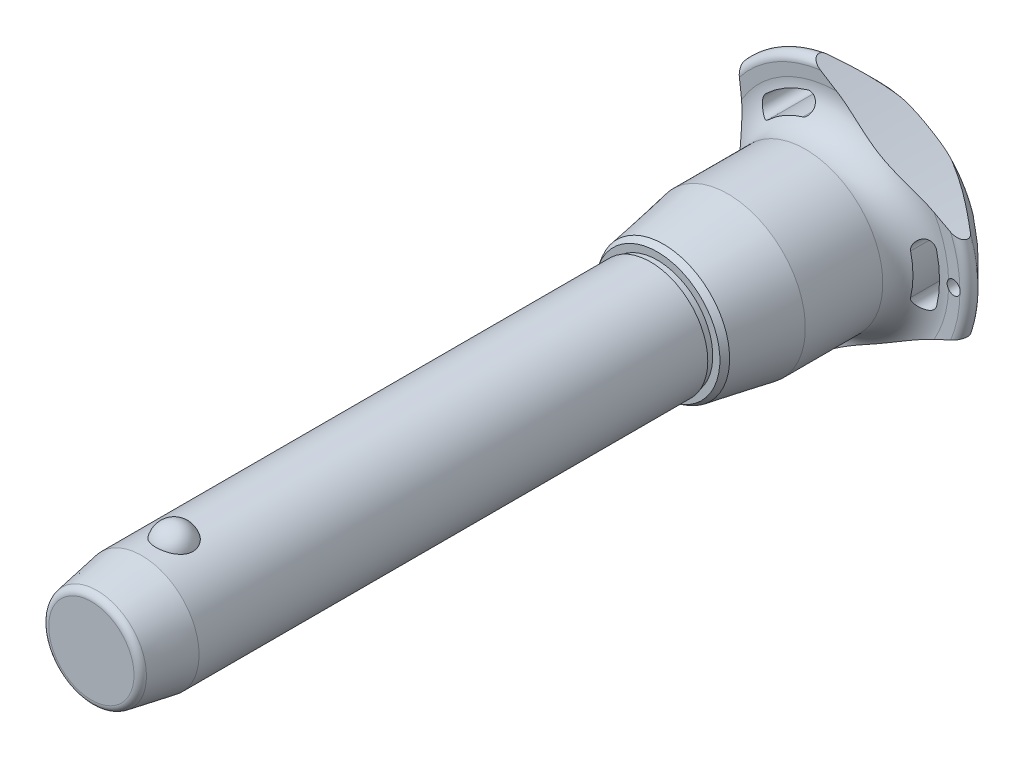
from build123d import *

# Parameters (mm, degrees)
SKETCH1_R           = 12.5
BOSS_EXTRUDE1_DEPTH = 100
SKETCH2_R           = 10
BOSS_EXTRUDE2_DEPTH = 50.7
BOSS_EXTRUDE3_START = 22
SKETCH1_2_R         = 12.5
BOSS_EXTRUDE3_DEPTH = 22
CHAMFER1_SIZE       = 11
CHAMFER1_SIZE2      = 1.939596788
FILLET1_R           = 1.5
SKETCH6_R           = 176.92625
CUT_EXTRUDE1_DEPTH  = 157.015516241
CIRPATTERN1_COUNT   = 3
SKETCH7_R           = 1.5
CUT_EXTRUDE2_DEPTH  = 156.917913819


with BuildPart() as part:
    # Sketch1 → Boss-Extrude1 (new body)
    with BuildSketch(Plane.XY):
        Circle(SKETCH1_R)
    extrude(amount=-BOSS_EXTRUDE1_DEPTH)

    # Sketch2 → Boss-Extrude2 (add)
    with BuildSketch(Plane(origin=(0, 0, -100), x_dir=(-1, 0, 0), z_dir=(0, 0, -1))):
        with Locations(Location((0, 0, 0), (0, 0, 180))):
            Circle(SKETCH2_R)
    extrude(amount=BOSS_EXTRUDE2_DEPTH)

    # Sketch3 → Revolve1 (revolve)
    with BuildSketch(Plane(origin=(0, 0, 0), x_dir=(0, 0, -1), z_dir=(1, 0, 0))):
        with BuildLine():
            Line((-3.957271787, 15.4), (-3.957271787, 7.1))
            ThreePointArc((-3.957271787, 7.1), (0.192728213, 11.25), (-3.957271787, 15.4))
        make_face()
        with BuildLine():
            Line((-3.957271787, -7.1), (-3.957271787, -15.4))
            ThreePointArc((-3.957271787, -15.4), (0.192728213, -11.25), (-3.957271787, -7.1))
        make_face()
    revolve(axis=Axis((0, -7.1, 3.957271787), (0, 1, 0)))

    # Sketch1_2 → Boss-Extrude3 (add)
    with BuildSketch(Plane.XY.offset(BOSS_EXTRUDE3_START)):
        Circle(SKETCH1_2_R)
    extrude(amount=-BOSS_EXTRUDE3_DEPTH)

    # Chamfer1
    chamfer1_edges = [part.edges().sort_by_distance(p)[0] for p in [
        (-12.5, 0, 22),
    ]]
    chamfer1_side = [part.faces().sort_by_distance(p)[0] for p in [
        (-12.5, 0, -39),
    ]]
    chamfer(chamfer1_edges, length=CHAMFER1_SIZE, length2=CHAMFER1_SIZE2, reference=chamfer1_side[0])

    # Fillet1
    fillet1_edges = [part.edges().sort_by_distance(p)[0] for p in [
        (-10.560403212, 0, 22),
        (-10, 0, -150.7),
    ]]
    fillet(fillet1_edges, radius=FILLET1_R)

    # Sketch4 → Revolve2 (revolve)
    with BuildSketch(Plane(origin=(0, 0, 0), x_dir=(0, 0, -1), z_dir=(1, 0, 0)), mode=Mode.PRIVATE) as revolve2_sk:
        Polygon((100, 0), (100, 12.089202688), (101.5, 12.089202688), (101.5, 13.644437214), (102.846872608, 14.422054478), (116.9, 16.9), (133.8, 16.9), (133.8, 0), align=None)
    revolve(revolve2_sk.sketch.rotate(Axis((0, 0, -133.8), (0, 0, 1)), 90), axis=Axis((0, 0, -133.8), (0, 0, 1)))

    # Sketch5 → Revolve3 (revolve)
    with BuildSketch(Plane(origin=(0, 0, 0), x_dir=(0, 0, -1), z_dir=(1, 0, 0)), mode=Mode.PRIVATE) as revolve3_sk:
        with BuildLine():
            Line((140.790129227, 24.271609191), (140.652256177, 26.865060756))
            ThreePointArc((140.652256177, 26.865060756), (141.598671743, 28.411427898), (143.38137085, 28.08137085))
            Line((143.38137085, 28.08137085), (149.763226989, 21.69951471))
            ThreePointArc((149.763226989, 21.69951471), (150.7, 19.381044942), (149.683055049, 17.096604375))
            ThreePointArc((149.683055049, 17.096604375), (144.18864484, 9.321268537), (142.25, 0))
            Line((142.25, 0), (133.8, 0))
            Line((133.8, 0), (133.8, 16.9))
            ThreePointArc((133.8, 16.9), (138.879432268, 19.083427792), (140.790129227, 24.271609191))
        make_face()
    revolve(revolve3_sk.sketch.rotate(Axis((0, 0, -142.25), (0, 0, 1)), 90), axis=Axis((0, 0, -142.25), (0, 0, 1)))

    # Sketch6 → Cut-Extrude1 (cut, through all)
    with BuildSketch(Plane.XY):
        with Locations((-197.42625, 0)):
            Circle(SKETCH6_R)
        with BuildLine():
            ThreePointArc((21.802992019, -5.260839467), (22.428706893, 0), (21.802992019, 5.260839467))
            ThreePointArc((21.802992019, 5.260839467), (19.579234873, 6.620060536), (18.220013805, 4.39630339))
            ThreePointArc((18.220013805, 4.39630339), (18.742902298, 0), (18.220013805, -4.39630339))
            ThreePointArc((18.220013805, -4.39630339), (19.579234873, -6.620060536), (21.802992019, -5.260839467))
        make_face()
    cut_extrude1 = extrude(amount=-CUT_EXTRUDE1_DEPTH, mode=Mode.SUBTRACT)

    # CirPattern1: Cut-Extrude1 ×3 about axis
    cirpattern1_axis = Axis((0, 0, 0), (0, 0, 1))
    for i in range(1, CIRPATTERN1_COUNT):
        add(cut_extrude1.rotate(cirpattern1_axis, i * 360 / CIRPATTERN1_COUNT), mode=Mode.SUBTRACT)

    # Sketch7 → Cut-Extrude2 (cut, through all)
    with BuildSketch(Plane.XY):
        with Locations(Location((25.428706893, 0, 0), (0, 0, 17.230769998))):
            Circle(SKETCH7_R)
    extrude(amount=-CUT_EXTRUDE2_DEPTH, mode=Mode.SUBTRACT)


solid = part.part
